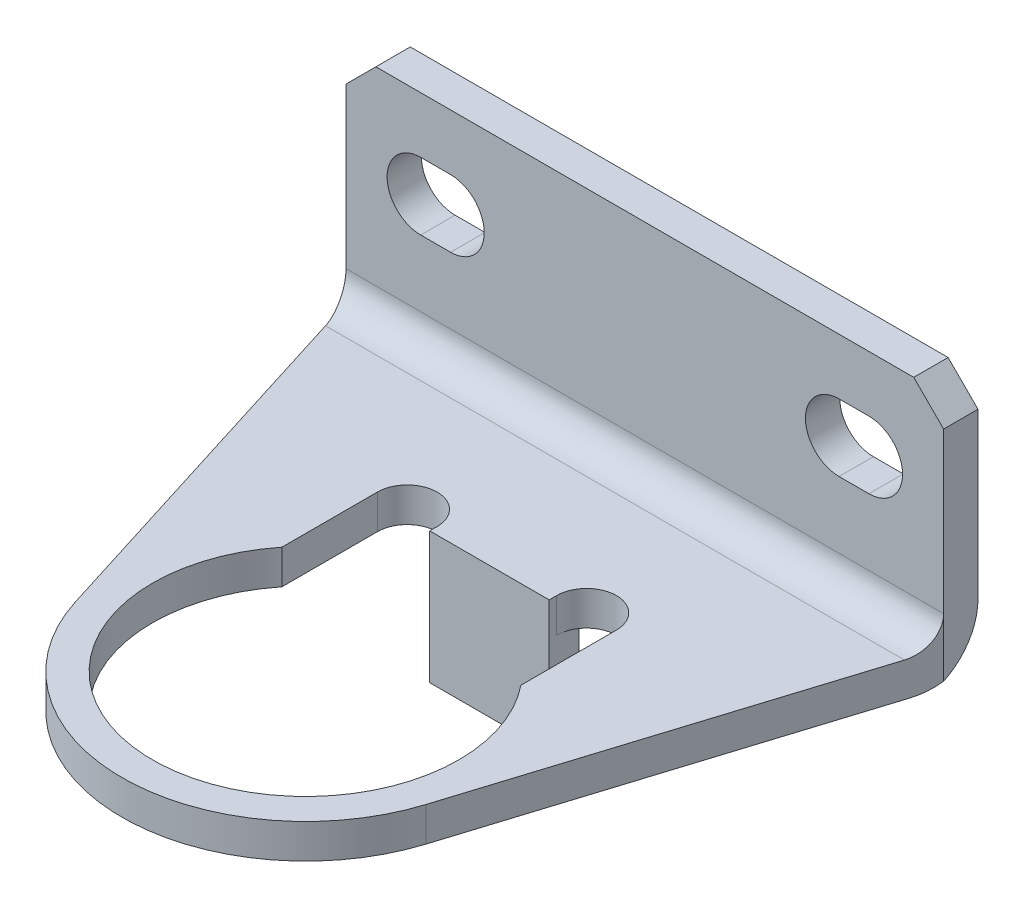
ISO-10303-21;
HEADER;
FILE_DESCRIPTION(('STEP AP214'),'2;1');
FILE_NAME('part.step','',(''),(''),'','','');
FILE_SCHEMA(('AUTOMOTIVE_DESIGN { 1 0 10303 214 1 1 1 1 }'));
ENDSEC;
DATA;
#1=APPLICATION_CONTEXT('core data for automotive mechanical design processes');
#2=APPLICATION_PROTOCOL_DEFINITION('international standard','automotive_design',2000,#1);
#3=PRODUCT_CONTEXT('',#1,'mechanical');
#4=PRODUCT('Part','Part','',(#3));
#5=PRODUCT_RELATED_PRODUCT_CATEGORY('part','',(#4));
#6=PRODUCT_DEFINITION_FORMATION('','',#4);
#7=PRODUCT_DEFINITION_CONTEXT('part definition',#1,'design');
#8=PRODUCT_DEFINITION('design','',#6,#7);
#9=PRODUCT_DEFINITION_SHAPE('','',#8);
#10=(LENGTH_UNIT() NAMED_UNIT(*) SI_UNIT(.MILLI.,.METRE.));
#11=(NAMED_UNIT(*) PLANE_ANGLE_UNIT() SI_UNIT($,.RADIAN.));
#12=(NAMED_UNIT(*) SI_UNIT($,.STERADIAN.) SOLID_ANGLE_UNIT());
#13=UNCERTAINTY_MEASURE_WITH_UNIT(LENGTH_MEASURE(1.E-05),#10,'distance_accuracy_value','');
#14=(GEOMETRIC_REPRESENTATION_CONTEXT(3) GLOBAL_UNCERTAINTY_ASSIGNED_CONTEXT((#13)) GLOBAL_UNIT_ASSIGNED_CONTEXT((#10,
#11,#12)) REPRESENTATION_CONTEXT('',''));
#15=CARTESIAN_POINT('',(0.,0.,0.));
#16=DIRECTION('',(0.,0.,1.));
#17=DIRECTION('',(1.,0.,0.));
#18=AXIS2_PLACEMENT_3D('',#15,#16,#17);
#19=CARTESIAN_POINT('',(-20.,0.,-2.3));
#20=DIRECTION('',(0.,-1.,0.));
#21=DIRECTION('',(0.,0.,-1.));
#22=AXIS2_PLACEMENT_3D('',#19,#20,#21);
#23=PLANE('',#22);
#24=DIRECTION('',(0.298922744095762,0.,0.95427731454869));
#25=VECTOR('',#24,1.);
#26=CARTESIAN_POINT('',(-20.,0.,0.));
#27=LINE('',#26,#25);
#28=CARTESIAN_POINT('',(-19.4674832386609,0.,1.7));
#29=VERTEX_POINT('',#28);
#30=CARTESIAN_POINT('',(-11.7376109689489,0.,26.3767497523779));
#31=VERTEX_POINT('',#30);
#32=EDGE_CURVE('E363',#29,#31,#27,.T.);
#33=ORIENTED_EDGE('',*,*,#32,.F.);
#34=DIRECTION('',(1.,0.,0.));
#35=VECTOR('',#34,1.);
#36=CARTESIAN_POINT('',(20.,0.,1.7));
#37=LINE('',#36,#35);
#38=CARTESIAN_POINT('',(19.467483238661,0.,1.7));
#39=VERTEX_POINT('',#38);
#40=EDGE_CURVE('E243',#29,#39,#37,.T.);
#41=ORIENTED_EDGE('',*,*,#40,.T.);
#42=DIRECTION('',(0.298922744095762,0.,-0.95427731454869));
#43=VECTOR('',#42,1.);
#44=CARTESIAN_POINT('',(20.,0.,0.));
#45=LINE('',#44,#43);
#46=CARTESIAN_POINT('',(11.7376109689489,0.,26.3767497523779));
#47=VERTEX_POINT('',#46);
#48=EDGE_CURVE('E307',#47,#39,#45,.T.);
#49=ORIENTED_EDGE('',*,*,#48,.F.);
#50=CARTESIAN_POINT('',(0.,0.,22.7));
#51=DIRECTION('',(0.,1.,0.));
#52=DIRECTION('',(0.,0.,1.));
#53=AXIS2_PLACEMENT_3D('',#50,#51,#52);
#54=CIRCLE('',#53,12.3);
#55=EDGE_CURVE('E365',#31,#47,#54,.T.);
#56=ORIENTED_EDGE('',*,*,#55,.F.);
#57=EDGE_LOOP('',(#33,#41,#49,#56));
#58=FACE_BOUND('',#57,.T.);
#59=DIRECTION('',(-1.,0.,0.));
#60=VECTOR('',#59,1.);
#61=CARTESIAN_POINT('',(-4.,0.,8.4));
#62=LINE('',#61,#60);
#63=CARTESIAN_POINT('',(4.,0.,8.4));
#64=VERTEX_POINT('',#63);
#65=CARTESIAN_POINT('',(-4.,0.,8.4));
#66=VERTEX_POINT('',#65);
#67=EDGE_CURVE('E233',#64,#66,#62,.T.);
#68=ORIENTED_EDGE('',*,*,#67,.T.);
#69=DIRECTION('',(0.,0.,1.));
#70=VECTOR('',#69,1.);
#71=CARTESIAN_POINT('',(-4.,0.,10.4));
#72=LINE('',#71,#70);
#73=CARTESIAN_POINT('',(-4.,0.,9.9));
#74=VERTEX_POINT('',#73);
#75=EDGE_CURVE('E237',#66,#74,#72,.T.);
#76=ORIENTED_EDGE('',*,*,#75,.T.);
#77=CARTESIAN_POINT('',(-6.,0.,9.9));
#78=DIRECTION('',(0.,1.,0.));
#79=DIRECTION('',(0.,0.,1.));
#80=AXIS2_PLACEMENT_3D('',#77,#78,#79);
#81=CIRCLE('',#80,2.);
#82=CARTESIAN_POINT('',(-8.,0.,9.9));
#83=VERTEX_POINT('',#82);
#84=EDGE_CURVE('E274',#74,#83,#81,.T.);
#85=ORIENTED_EDGE('',*,*,#84,.T.);
#86=DIRECTION('',(0.,0.,1.));
#87=VECTOR('',#86,1.);
#88=CARTESIAN_POINT('',(-8.,0.,9.9));
#89=LINE('',#88,#87);
#90=CARTESIAN_POINT('',(-8.,0.,16.2919971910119));
#91=VERTEX_POINT('',#90);
#92=EDGE_CURVE('E277',#83,#91,#89,.T.);
#93=ORIENTED_EDGE('',*,*,#92,.T.);
#94=CARTESIAN_POINT('',(0.,0.,22.7));
#95=DIRECTION('',(0.,1.,0.));
#96=DIRECTION('',(0.,0.,1.));
#97=AXIS2_PLACEMENT_3D('',#94,#95,#96);
#98=CIRCLE('',#97,10.25);
#99=CARTESIAN_POINT('',(8.,0.,16.2919971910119));
#100=VERTEX_POINT('',#99);
#101=EDGE_CURVE('E357',#91,#100,#98,.T.);
#102=ORIENTED_EDGE('',*,*,#101,.T.);
#103=DIRECTION('',(0.,0.,-1.));
#104=VECTOR('',#103,1.);
#105=CARTESIAN_POINT('',(8.00000000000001,0.,9.9));
#106=LINE('',#105,#104);
#107=CARTESIAN_POINT('',(8.,0.,9.9));
#108=VERTEX_POINT('',#107);
#109=EDGE_CURVE('E264',#100,#108,#106,.T.);
#110=ORIENTED_EDGE('',*,*,#109,.T.);
#111=CARTESIAN_POINT('',(6.,0.,9.9));
#112=DIRECTION('',(0.,1.,0.));
#113=DIRECTION('',(0.,0.,-1.));
#114=AXIS2_PLACEMENT_3D('',#111,#112,#113);
#115=CIRCLE('',#114,2.);
#116=CARTESIAN_POINT('',(4.,0.,9.9));
#117=VERTEX_POINT('',#116);
#118=EDGE_CURVE('E242',#108,#117,#115,.T.);
#119=ORIENTED_EDGE('',*,*,#118,.T.);
#120=DIRECTION('',(0.,0.,-1.));
#121=VECTOR('',#120,1.);
#122=CARTESIAN_POINT('',(4.,0.,10.4));
#123=LINE('',#122,#121);
#124=EDGE_CURVE('E221',#117,#64,#123,.T.);
#125=ORIENTED_EDGE('',*,*,#124,.T.);
#126=EDGE_LOOP('',(#68,#76,#85,#93,#102,#110,#119,#125));
#127=FACE_BOUND('',#126,.T.);
#128=ADVANCED_FACE('F31',(#58,#127),#23,.T.);
#129=CARTESIAN_POINT('',(0.,2.3,22.7));
#130=DIRECTION('',(0.,1.,0.));
#131=DIRECTION('',(0.,0.,1.));
#132=AXIS2_PLACEMENT_3D('',#129,#130,#131);
#133=PLANE('',#132);
#134=DIRECTION('',(0.298922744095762,0.,-0.95427731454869));
#135=VECTOR('',#134,1.);
#136=CARTESIAN_POINT('',(20.,2.3,0.));
#137=LINE('',#136,#135);
#138=CARTESIAN_POINT('',(11.7376109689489,2.3,26.3767497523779));
#139=VERTEX_POINT('',#138);
#140=CARTESIAN_POINT('',(19.3735096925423,2.3,2.));
#141=VERTEX_POINT('',#140);
#142=EDGE_CURVE('E318',#139,#141,#137,.T.);
#143=ORIENTED_EDGE('',*,*,#142,.T.);
#144=DIRECTION('',(-1.,0.,0.));
#145=VECTOR('',#144,1.);
#146=CARTESIAN_POINT('',(-20.,2.3,2.));
#147=LINE('',#146,#145);
#148=CARTESIAN_POINT('',(-19.3735096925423,2.3,2.));
#149=VERTEX_POINT('',#148);
#150=EDGE_CURVE('E582',#141,#149,#147,.T.);
#151=ORIENTED_EDGE('',*,*,#150,.T.);
#152=DIRECTION('',(0.298922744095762,0.,0.95427731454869));
#153=VECTOR('',#152,1.);
#154=CARTESIAN_POINT('',(-20.,2.3,0.));
#155=LINE('',#154,#153);
#156=CARTESIAN_POINT('',(-11.7376109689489,2.3,26.3767497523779));
#157=VERTEX_POINT('',#156);
#158=EDGE_CURVE('E303',#149,#157,#155,.T.);
#159=ORIENTED_EDGE('',*,*,#158,.T.);
#160=CARTESIAN_POINT('',(0.,2.3,22.7));
#161=DIRECTION('',(0.,1.,0.));
#162=DIRECTION('',(0.,0.,1.));
#163=AXIS2_PLACEMENT_3D('',#160,#161,#162);
#164=CIRCLE('',#163,12.3);
#165=EDGE_CURVE('E306',#157,#139,#164,.T.);
#166=ORIENTED_EDGE('',*,*,#165,.T.);
#167=EDGE_LOOP('',(#143,#151,#159,#166));
#168=FACE_BOUND('',#167,.T.);
#169=CARTESIAN_POINT('',(0.,2.3,22.7));
#170=DIRECTION('',(0.,1.,0.));
#171=DIRECTION('',(0.,0.,1.));
#172=AXIS2_PLACEMENT_3D('',#169,#170,#171);
#173=CIRCLE('',#172,10.25);
#174=CARTESIAN_POINT('',(-8.,2.3,16.2919971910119));
#175=VERTEX_POINT('',#174);
#176=CARTESIAN_POINT('',(8.,2.3,16.2919971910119));
#177=VERTEX_POINT('',#176);
#178=EDGE_CURVE('E360',#175,#177,#173,.T.);
#179=ORIENTED_EDGE('',*,*,#178,.F.);
#180=DIRECTION('',(0.,0.,-1.));
#181=VECTOR('',#180,1.);
#182=CARTESIAN_POINT('',(-8.,2.3,22.7));
#183=LINE('',#182,#181);
#184=CARTESIAN_POINT('',(-8.,2.3,9.9));
#185=VERTEX_POINT('',#184);
#186=EDGE_CURVE('E354',#175,#185,#183,.T.);
#187=ORIENTED_EDGE('',*,*,#186,.T.);
#188=CARTESIAN_POINT('',(-6.,2.3,9.9));
#189=DIRECTION('',(0.,1.,0.));
#190=DIRECTION('',(0.,0.,1.));
#191=AXIS2_PLACEMENT_3D('',#188,#189,#190);
#192=CIRCLE('',#191,2.);
#193=CARTESIAN_POINT('',(-4.,2.3,9.9));
#194=VERTEX_POINT('',#193);
#195=EDGE_CURVE('E244',#185,#194,#192,.F.);
#196=ORIENTED_EDGE('',*,*,#195,.T.);
#197=DIRECTION('',(0.,0.,1.));
#198=VECTOR('',#197,1.);
#199=CARTESIAN_POINT('',(-4.,2.3,22.7));
#200=LINE('',#199,#198);
#201=CARTESIAN_POINT('',(-4.,2.3,10.4));
#202=VERTEX_POINT('',#201);
#203=EDGE_CURVE('E250',#194,#202,#200,.T.);
#204=ORIENTED_EDGE('',*,*,#203,.T.);
#205=DIRECTION('',(1.,0.,0.));
#206=VECTOR('',#205,1.);
#207=CARTESIAN_POINT('',(0.,2.3,10.4));
#208=LINE('',#207,#206);
#209=CARTESIAN_POINT('',(4.,2.3,10.4));
#210=VERTEX_POINT('',#209);
#211=EDGE_CURVE('E331',#202,#210,#208,.T.);
#212=ORIENTED_EDGE('',*,*,#211,.T.);
#213=DIRECTION('',(0.,0.,-1.));
#214=VECTOR('',#213,1.);
#215=CARTESIAN_POINT('',(4.,2.3,22.7));
#216=LINE('',#215,#214);
#217=CARTESIAN_POINT('',(4.,2.3,9.9));
#218=VERTEX_POINT('',#217);
#219=EDGE_CURVE('E334',#210,#218,#216,.T.);
#220=ORIENTED_EDGE('',*,*,#219,.T.);
#221=CARTESIAN_POINT('',(6.,2.3,9.9));
#222=DIRECTION('',(0.,1.,0.));
#223=DIRECTION('',(0.,0.,1.));
#224=AXIS2_PLACEMENT_3D('',#221,#222,#223);
#225=CIRCLE('',#224,2.);
#226=CARTESIAN_POINT('',(8.,2.3,9.9));
#227=VERTEX_POINT('',#226);
#228=EDGE_CURVE('E337',#218,#227,#225,.F.);
#229=ORIENTED_EDGE('',*,*,#228,.T.);
#230=DIRECTION('',(0.,0.,1.));
#231=VECTOR('',#230,1.);
#232=CARTESIAN_POINT('',(8.,2.3,22.7));
#233=LINE('',#232,#231);
#234=EDGE_CURVE('E270',#227,#177,#233,.T.);
#235=ORIENTED_EDGE('',*,*,#234,.T.);
#236=EDGE_LOOP('',(#179,#187,#196,#204,#212,#220,#229,#235));
#237=FACE_BOUND('',#236,.T.);
#238=ADVANCED_FACE('F468',(#168,#237),#133,.T.);
#239=CARTESIAN_POINT('',(0.,2.3,22.7));
#240=DIRECTION('',(0.,-1.,0.));
#241=DIRECTION('',(0.,0.,-1.));
#242=AXIS2_PLACEMENT_3D('',#239,#240,#241);
#243=CYLINDRICAL_SURFACE('',#242,10.25);
#244=ORIENTED_EDGE('',*,*,#101,.F.);
#245=DIRECTION('',(0.,-1.,0.));
#246=VECTOR('',#245,1.);
#247=CARTESIAN_POINT('',(-8.,2.3,16.2919971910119));
#248=LINE('',#247,#246);
#249=EDGE_CURVE('E327',#91,#175,#248,.F.);
#250=ORIENTED_EDGE('',*,*,#249,.T.);
#251=ORIENTED_EDGE('',*,*,#178,.T.);
#252=DIRECTION('',(0.,-1.,0.));
#253=VECTOR('',#252,1.);
#254=CARTESIAN_POINT('',(8.,2.3,16.2919971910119));
#255=LINE('',#254,#253);
#256=EDGE_CURVE('E324',#177,#100,#255,.T.);
#257=ORIENTED_EDGE('',*,*,#256,.T.);
#258=EDGE_LOOP('',(#244,#250,#251,#257));
#259=FACE_BOUND('',#258,.T.);
#260=ADVANCED_FACE('F474',(#259),#243,.F.);
#261=CARTESIAN_POINT('',(-20.,0.,-2.3));
#262=DIRECTION('',(0.,0.,1.));
#263=DIRECTION('',(1.,0.,0.));
#264=AXIS2_PLACEMENT_3D('',#261,#262,#263);
#265=PLANE('',#264);
#266=DIRECTION('',(0.,1.,0.));
#267=VECTOR('',#266,1.);
#268=CARTESIAN_POINT('',(20.,17.,-2.3));
#269=LINE('',#268,#267);
#270=CARTESIAN_POINT('',(20.,4.,-2.3));
#271=VERTEX_POINT('',#270);
#272=CARTESIAN_POINT('',(20.,15.,-2.3));
#273=VERTEX_POINT('',#272);
#274=EDGE_CURVE('E631',#271,#273,#269,.T.);
#275=ORIENTED_EDGE('',*,*,#274,.F.);
#276=DIRECTION('',(1.,0.,0.));
#277=VECTOR('',#276,1.);
#278=CARTESIAN_POINT('',(-20.,4.,-2.3));
#279=LINE('',#278,#277);
#280=CARTESIAN_POINT('',(-20.,4.,-2.3));
#281=VERTEX_POINT('',#280);
#282=EDGE_CURVE('E298',#271,#281,#279,.F.);
#283=ORIENTED_EDGE('',*,*,#282,.T.);
#284=DIRECTION('',(0.,-1.,0.));
#285=VECTOR('',#284,1.);
#286=CARTESIAN_POINT('',(-20.,17.,-2.3));
#287=LINE('',#286,#285);
#288=CARTESIAN_POINT('',(-20.,15.,-2.3));
#289=VERTEX_POINT('',#288);
#290=EDGE_CURVE('E628',#289,#281,#287,.T.);
#291=ORIENTED_EDGE('',*,*,#290,.F.);
#292=DIRECTION('',(-0.707106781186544,-0.707106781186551,0.));
#293=VECTOR('',#292,1.);
#294=CARTESIAN_POINT('',(-18.,17.,-2.3));
#295=LINE('',#294,#293);
#296=CARTESIAN_POINT('',(-18.,17.,-2.3));
#297=VERTEX_POINT('',#296);
#298=EDGE_CURVE('E621',#289,#297,#295,.F.);
#299=ORIENTED_EDGE('',*,*,#298,.T.);
#300=DIRECTION('',(-1.,0.,0.));
#301=VECTOR('',#300,1.);
#302=CARTESIAN_POINT('',(-20.,17.,-2.3));
#303=LINE('',#302,#301);
#304=CARTESIAN_POINT('',(18.,17.,-2.3));
#305=VERTEX_POINT('',#304);
#306=EDGE_CURVE('E626',#305,#297,#303,.T.);
#307=ORIENTED_EDGE('',*,*,#306,.F.);
#308=DIRECTION('',(-0.707106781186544,0.707106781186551,0.));
#309=VECTOR('',#308,1.);
#310=CARTESIAN_POINT('',(20.,15.,-2.3));
#311=LINE('',#310,#309);
#312=EDGE_CURVE('E618',#305,#273,#311,.F.);
#313=ORIENTED_EDGE('',*,*,#312,.T.);
#314=EDGE_LOOP('',(#275,#283,#291,#299,#307,#313));
#315=FACE_BOUND('',#314,.T.);
#316=DIRECTION('',(1.,0.,0.));
#317=VECTOR('',#316,1.);
#318=CARTESIAN_POINT('',(-15.,13.25,-2.3));
#319=LINE('',#318,#317);
#320=CARTESIAN_POINT('',(-15.,13.25,-2.3));
#321=VERTEX_POINT('',#320);
#322=CARTESIAN_POINT('',(-13.,13.25,-2.3));
#323=VERTEX_POINT('',#322);
#324=EDGE_CURVE('E424',#321,#323,#319,.T.);
#325=ORIENTED_EDGE('',*,*,#324,.F.);
#326=CARTESIAN_POINT('',(-15.,11.,-2.3));
#327=DIRECTION('',(0.,0.,1.));
#328=DIRECTION('',(1.,0.,0.));
#329=AXIS2_PLACEMENT_3D('',#326,#327,#328);
#330=CIRCLE('',#329,2.25);
#331=CARTESIAN_POINT('',(-15.,8.75000000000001,-2.3));
#332=VERTEX_POINT('',#331);
#333=EDGE_CURVE('E416',#321,#332,#330,.T.);
#334=ORIENTED_EDGE('',*,*,#333,.T.);
#335=DIRECTION('',(-1.,0.,0.));
#336=VECTOR('',#335,1.);
#337=CARTESIAN_POINT('',(-13.,8.75000000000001,-2.3));
#338=LINE('',#337,#336);
#339=CARTESIAN_POINT('',(-13.,8.75000000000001,-2.3));
#340=VERTEX_POINT('',#339);
#341=EDGE_CURVE('E419',#340,#332,#338,.T.);
#342=ORIENTED_EDGE('',*,*,#341,.F.);
#343=CARTESIAN_POINT('',(-13.,11.,-2.3));
#344=DIRECTION('',(0.,0.,-1.));
#345=DIRECTION('',(-1.,0.,0.));
#346=AXIS2_PLACEMENT_3D('',#343,#344,#345);
#347=CIRCLE('',#346,2.25);
#348=EDGE_CURVE('E421',#323,#340,#347,.T.);
#349=ORIENTED_EDGE('',*,*,#348,.F.);
#350=EDGE_LOOP('',(#325,#334,#342,#349));
#351=FACE_BOUND('',#350,.T.);
#352=CARTESIAN_POINT('',(15.,11.,-2.3));
#353=DIRECTION('',(0.,0.,-1.));
#354=DIRECTION('',(-1.,0.,0.));
#355=AXIS2_PLACEMENT_3D('',#352,#353,#354);
#356=CIRCLE('',#355,2.24999999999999);
#357=CARTESIAN_POINT('',(15.,13.25,-2.3));
#358=VERTEX_POINT('',#357);
#359=CARTESIAN_POINT('',(15.,8.75000000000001,-2.3));
#360=VERTEX_POINT('',#359);
#361=EDGE_CURVE('E385',#358,#360,#356,.T.);
#362=ORIENTED_EDGE('',*,*,#361,.F.);
#363=DIRECTION('',(-1.,0.,0.));
#364=VECTOR('',#363,1.);
#365=CARTESIAN_POINT('',(15.,13.25,-2.3));
#366=LINE('',#365,#364);
#367=CARTESIAN_POINT('',(13.,13.25,-2.3));
#368=VERTEX_POINT('',#367);
#369=EDGE_CURVE('E393',#358,#368,#366,.T.);
#370=ORIENTED_EDGE('',*,*,#369,.T.);
#371=CARTESIAN_POINT('',(13.,11.,-2.3));
#372=DIRECTION('',(0.,0.,1.));
#373=DIRECTION('',(1.,0.,0.));
#374=AXIS2_PLACEMENT_3D('',#371,#372,#373);
#375=CIRCLE('',#374,2.24999999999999);
#376=CARTESIAN_POINT('',(13.,8.75000000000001,-2.3));
#377=VERTEX_POINT('',#376);
#378=EDGE_CURVE('E390',#368,#377,#375,.T.);
#379=ORIENTED_EDGE('',*,*,#378,.T.);
#380=DIRECTION('',(1.,0.,0.));
#381=VECTOR('',#380,1.);
#382=CARTESIAN_POINT('',(13.,8.75000000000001,-2.3));
#383=LINE('',#382,#381);
#384=EDGE_CURVE('E387',#377,#360,#383,.T.);
#385=ORIENTED_EDGE('',*,*,#384,.T.);
#386=EDGE_LOOP('',(#362,#370,#379,#385));
#387=FACE_BOUND('',#386,.T.);
#388=ADVANCED_FACE('F452',(#315,#351,#387),#265,.F.);
#389=CARTESIAN_POINT('',(-20.,0.,0.));
#390=DIRECTION('',(0.,0.,1.));
#391=DIRECTION('',(1.,0.,0.));
#392=AXIS2_PLACEMENT_3D('',#389,#390,#391);
#393=PLANE('',#392);
#394=DIRECTION('',(0.,-1.,0.));
#395=VECTOR('',#394,1.);
#396=CARTESIAN_POINT('',(-20.,17.,0.));
#397=LINE('',#396,#395);
#398=CARTESIAN_POINT('',(-20.,15.,0.));
#399=VERTEX_POINT('',#398);
#400=CARTESIAN_POINT('',(-20.,4.3,0.));
#401=VERTEX_POINT('',#400);
#402=EDGE_CURVE('E295',#399,#401,#397,.T.);
#403=ORIENTED_EDGE('',*,*,#402,.T.);
#404=DIRECTION('',(-1.,0.,0.));
#405=VECTOR('',#404,1.);
#406=CARTESIAN_POINT('',(20.,4.3,0.));
#407=LINE('',#406,#405);
#408=CARTESIAN_POINT('',(20.,4.3,0.));
#409=VERTEX_POINT('',#408);
#410=EDGE_CURVE('E580',#401,#409,#407,.F.);
#411=ORIENTED_EDGE('',*,*,#410,.T.);
#412=DIRECTION('',(0.,1.,0.));
#413=VECTOR('',#412,1.);
#414=CARTESIAN_POINT('',(20.,17.,0.));
#415=LINE('',#414,#413);
#416=CARTESIAN_POINT('',(20.,15.,0.));
#417=VERTEX_POINT('',#416);
#418=EDGE_CURVE('E285',#409,#417,#415,.T.);
#419=ORIENTED_EDGE('',*,*,#418,.T.);
#420=DIRECTION('',(0.707106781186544,-0.707106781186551,0.));
#421=VECTOR('',#420,1.);
#422=CARTESIAN_POINT('',(7.50000000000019,27.4999999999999,0.));
#423=LINE('',#422,#421);
#424=CARTESIAN_POINT('',(18.,17.,0.));
#425=VERTEX_POINT('',#424);
#426=EDGE_CURVE('E603',#417,#425,#423,.F.);
#427=ORIENTED_EDGE('',*,*,#426,.T.);
#428=DIRECTION('',(-1.,0.,0.));
#429=VECTOR('',#428,1.);
#430=CARTESIAN_POINT('',(-20.,17.,0.));
#431=LINE('',#430,#429);
#432=CARTESIAN_POINT('',(-18.,17.,0.));
#433=VERTEX_POINT('',#432);
#434=EDGE_CURVE('E284',#425,#433,#431,.T.);
#435=ORIENTED_EDGE('',*,*,#434,.T.);
#436=DIRECTION('',(0.707106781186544,0.707106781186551,0.));
#437=VECTOR('',#436,1.);
#438=CARTESIAN_POINT('',(-27.5,7.49999999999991,0.));
#439=LINE('',#438,#437);
#440=EDGE_CURVE('E608',#433,#399,#439,.F.);
#441=ORIENTED_EDGE('',*,*,#440,.T.);
#442=EDGE_LOOP('',(#403,#411,#419,#427,#435,#441));
#443=FACE_BOUND('',#442,.T.);
#444=CARTESIAN_POINT('',(-15.,11.,0.));
#445=DIRECTION('',(0.,0.,1.));
#446=DIRECTION('',(1.,0.,0.));
#447=AXIS2_PLACEMENT_3D('',#444,#445,#446);
#448=CIRCLE('',#447,2.25);
#449=CARTESIAN_POINT('',(-15.,13.25,0.));
#450=VERTEX_POINT('',#449);
#451=CARTESIAN_POINT('',(-15.,8.75000000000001,0.));
#452=VERTEX_POINT('',#451);
#453=EDGE_CURVE('E405',#450,#452,#448,.T.);
#454=ORIENTED_EDGE('',*,*,#453,.F.);
#455=DIRECTION('',(1.,0.,0.));
#456=VECTOR('',#455,1.);
#457=CARTESIAN_POINT('',(-15.,13.25,0.));
#458=LINE('',#457,#456);
#459=CARTESIAN_POINT('',(-13.,13.25,0.));
#460=VERTEX_POINT('',#459);
#461=EDGE_CURVE('E413',#450,#460,#458,.T.);
#462=ORIENTED_EDGE('',*,*,#461,.T.);
#463=CARTESIAN_POINT('',(-13.,11.,0.));
#464=DIRECTION('',(0.,0.,-1.));
#465=DIRECTION('',(-1.,0.,0.));
#466=AXIS2_PLACEMENT_3D('',#463,#464,#465);
#467=CIRCLE('',#466,2.25);
#468=CARTESIAN_POINT('',(-13.,8.75,0.));
#469=VERTEX_POINT('',#468);
#470=EDGE_CURVE('E410',#460,#469,#467,.T.);
#471=ORIENTED_EDGE('',*,*,#470,.T.);
#472=DIRECTION('',(-1.,0.,0.));
#473=VECTOR('',#472,1.);
#474=CARTESIAN_POINT('',(-13.,8.75000000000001,0.));
#475=LINE('',#474,#473);
#476=EDGE_CURVE('E407',#469,#452,#475,.T.);
#477=ORIENTED_EDGE('',*,*,#476,.T.);
#478=EDGE_LOOP('',(#454,#462,#471,#477));
#479=FACE_BOUND('',#478,.T.);
#480=DIRECTION('',(-1.,0.,0.));
#481=VECTOR('',#480,1.);
#482=CARTESIAN_POINT('',(15.,13.25,0.));
#483=LINE('',#482,#481);
#484=CARTESIAN_POINT('',(15.,13.25,0.));
#485=VERTEX_POINT('',#484);
#486=CARTESIAN_POINT('',(13.,13.25,0.));
#487=VERTEX_POINT('',#486);
#488=EDGE_CURVE('E382',#485,#487,#483,.T.);
#489=ORIENTED_EDGE('',*,*,#488,.F.);
#490=CARTESIAN_POINT('',(15.,11.,0.));
#491=DIRECTION('',(0.,0.,-1.));
#492=DIRECTION('',(-1.,0.,0.));
#493=AXIS2_PLACEMENT_3D('',#490,#491,#492);
#494=CIRCLE('',#493,2.24999999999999);
#495=CARTESIAN_POINT('',(15.,8.75000000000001,0.));
#496=VERTEX_POINT('',#495);
#497=EDGE_CURVE('E314',#485,#496,#494,.T.);
#498=ORIENTED_EDGE('',*,*,#497,.T.);
#499=DIRECTION('',(1.,0.,0.));
#500=VECTOR('',#499,1.);
#501=CARTESIAN_POINT('',(13.,8.75000000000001,0.));
#502=LINE('',#501,#500);
#503=CARTESIAN_POINT('',(13.,8.75000000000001,0.));
#504=VERTEX_POINT('',#503);
#505=EDGE_CURVE('E376',#504,#496,#502,.T.);
#506=ORIENTED_EDGE('',*,*,#505,.F.);
#507=CARTESIAN_POINT('',(13.,11.,0.));
#508=DIRECTION('',(0.,0.,1.));
#509=DIRECTION('',(1.,0.,0.));
#510=AXIS2_PLACEMENT_3D('',#507,#508,#509);
#511=CIRCLE('',#510,2.24999999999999);
#512=EDGE_CURVE('E379',#487,#504,#511,.T.);
#513=ORIENTED_EDGE('',*,*,#512,.F.);
#514=EDGE_LOOP('',(#489,#498,#506,#513));
#515=FACE_BOUND('',#514,.T.);
#516=ADVANCED_FACE('F442',(#443,#479,#515),#393,.T.);
#517=CARTESIAN_POINT('',(-20.,17.,-2.3));
#518=DIRECTION('',(-1.,0.,0.));
#519=DIRECTION('',(0.,-1.,0.));
#520=AXIS2_PLACEMENT_3D('',#517,#518,#519);
#521=PLANE('',#520);
#522=ORIENTED_EDGE('',*,*,#290,.T.);
#523=CARTESIAN_POINT('',(-20.,4.,1.7));
#524=DIRECTION('',(-1.,0.,0.));
#525=DIRECTION('',(0.,-1.,0.));
#526=AXIS2_PLACEMENT_3D('',#523,#524,#525);
#527=CIRCLE('',#526,4.);
#528=CARTESIAN_POINT('',(-20.,0.379226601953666,0.));
#529=VERTEX_POINT('',#528);
#530=EDGE_CURVE('E300',#281,#529,#527,.T.);
#531=ORIENTED_EDGE('',*,*,#530,.T.);
#532=DIRECTION('',(0.,-1.,0.));
#533=VECTOR('',#532,1.);
#534=CARTESIAN_POINT('',(-20.,2.3,0.));
#535=LINE('',#534,#533);
#536=EDGE_CURVE('E47',#401,#529,#535,.T.);
#537=ORIENTED_EDGE('',*,*,#536,.F.);
#538=ORIENTED_EDGE('',*,*,#402,.F.);
#539=DIRECTION('',(0.,0.,-1.));
#540=VECTOR('',#539,1.);
#541=CARTESIAN_POINT('',(-20.,15.,-2.3));
#542=LINE('',#541,#540);
#543=EDGE_CURVE('E611',#399,#289,#542,.T.);
#544=ORIENTED_EDGE('',*,*,#543,.T.);
#545=EDGE_LOOP('',(#522,#531,#537,#538,#544));
#546=FACE_BOUND('',#545,.T.);
#547=ADVANCED_FACE('F33',(#546),#521,.T.);
#548=CARTESIAN_POINT('',(-20.,17.,-2.3));
#549=DIRECTION('',(0.,1.,0.));
#550=DIRECTION('',(0.,0.,1.));
#551=AXIS2_PLACEMENT_3D('',#548,#549,#550);
#552=PLANE('',#551);
#553=ORIENTED_EDGE('',*,*,#306,.T.);
#554=DIRECTION('',(0.,0.,1.));
#555=VECTOR('',#554,1.);
#556=CARTESIAN_POINT('',(-18.,17.,-2.3));
#557=LINE('',#556,#555);
#558=EDGE_CURVE('E609',#297,#433,#557,.T.);
#559=ORIENTED_EDGE('',*,*,#558,.T.);
#560=ORIENTED_EDGE('',*,*,#434,.F.);
#561=DIRECTION('',(0.,0.,-1.));
#562=VECTOR('',#561,1.);
#563=CARTESIAN_POINT('',(18.,17.,-2.3));
#564=LINE('',#563,#562);
#565=EDGE_CURVE('E607',#425,#305,#564,.T.);
#566=ORIENTED_EDGE('',*,*,#565,.T.);
#567=EDGE_LOOP('',(#553,#559,#560,#566));
#568=FACE_BOUND('',#567,.T.);
#569=ADVANCED_FACE('F481',(#568),#552,.T.);
#570=CARTESIAN_POINT('',(20.,17.,-2.3));
#571=DIRECTION('',(1.,0.,0.));
#572=DIRECTION('',(0.,1.,0.));
#573=AXIS2_PLACEMENT_3D('',#570,#571,#572);
#574=PLANE('',#573);
#575=CARTESIAN_POINT('',(20.,0.379226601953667,0.));
#576=VERTEX_POINT('',#575);
#577=EDGE_CURVE('E280',#576,#409,#415,.T.);
#578=ORIENTED_EDGE('',*,*,#577,.F.);
#579=CARTESIAN_POINT('',(20.,4.,1.7));
#580=DIRECTION('',(1.,0.,0.));
#581=DIRECTION('',(0.,1.,0.));
#582=AXIS2_PLACEMENT_3D('',#579,#580,#581);
#583=CIRCLE('',#582,4.);
#584=EDGE_CURVE('E296',#576,#271,#583,.T.);
#585=ORIENTED_EDGE('',*,*,#584,.T.);
#586=ORIENTED_EDGE('',*,*,#274,.T.);
#587=DIRECTION('',(0.,0.,1.));
#588=VECTOR('',#587,1.);
#589=CARTESIAN_POINT('',(20.,15.,-2.3));
#590=LINE('',#589,#588);
#591=EDGE_CURVE('E328',#273,#417,#590,.T.);
#592=ORIENTED_EDGE('',*,*,#591,.T.);
#593=ORIENTED_EDGE('',*,*,#418,.F.);
#594=EDGE_LOOP('',(#578,#585,#586,#592,#593));
#595=FACE_BOUND('',#594,.T.);
#596=ADVANCED_FACE('F464',(#595),#574,.T.);
#597=CARTESIAN_POINT('',(-15.,11.,-2.3));
#598=DIRECTION('',(0.,0.,1.));
#599=DIRECTION('',(1.,0.,0.));
#600=AXIS2_PLACEMENT_3D('',#597,#598,#599);
#601=CYLINDRICAL_SURFACE('',#600,2.25);
#602=ORIENTED_EDGE('',*,*,#453,.T.);
#603=DIRECTION('',(0.,0.,1.));
#604=VECTOR('',#603,1.);
#605=CARTESIAN_POINT('',(-15.,8.75000000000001,-2.3));
#606=LINE('',#605,#604);
#607=EDGE_CURVE('E426',#332,#452,#606,.T.);
#608=ORIENTED_EDGE('',*,*,#607,.F.);
#609=ORIENTED_EDGE('',*,*,#333,.F.);
#610=DIRECTION('',(0.,0.,1.));
#611=VECTOR('',#610,1.);
#612=CARTESIAN_POINT('',(-15.,13.25,-2.3));
#613=LINE('',#612,#611);
#614=EDGE_CURVE('E427',#321,#450,#613,.T.);
#615=ORIENTED_EDGE('',*,*,#614,.T.);
#616=EDGE_LOOP('',(#602,#608,#609,#615));
#617=FACE_BOUND('',#616,.T.);
#618=ADVANCED_FACE('F454',(#617),#601,.F.);
#619=CARTESIAN_POINT('',(-15.,13.25,-2.3));
#620=DIRECTION('',(0.,-1.,0.));
#621=DIRECTION('',(0.,0.,-1.));
#622=AXIS2_PLACEMENT_3D('',#619,#620,#621);
#623=PLANE('',#622);
#624=ORIENTED_EDGE('',*,*,#461,.F.);
#625=ORIENTED_EDGE('',*,*,#614,.F.);
#626=ORIENTED_EDGE('',*,*,#324,.T.);
#627=DIRECTION('',(0.,0.,1.));
#628=VECTOR('',#627,1.);
#629=CARTESIAN_POINT('',(-13.,13.25,-2.3));
#630=LINE('',#629,#628);
#631=EDGE_CURVE('E429',#323,#460,#630,.T.);
#632=ORIENTED_EDGE('',*,*,#631,.T.);
#633=EDGE_LOOP('',(#624,#625,#626,#632));
#634=FACE_BOUND('',#633,.T.);
#635=ADVANCED_FACE('F456',(#634),#623,.T.);
#636=CARTESIAN_POINT('',(-13.,11.,-2.3));
#637=DIRECTION('',(0.,0.,1.));
#638=DIRECTION('',(1.,0.,0.));
#639=AXIS2_PLACEMENT_3D('',#636,#637,#638);
#640=CYLINDRICAL_SURFACE('',#639,2.25);
#641=ORIENTED_EDGE('',*,*,#470,.F.);
#642=ORIENTED_EDGE('',*,*,#631,.F.);
#643=ORIENTED_EDGE('',*,*,#348,.T.);
#644=DIRECTION('',(0.,0.,1.));
#645=VECTOR('',#644,1.);
#646=CARTESIAN_POINT('',(-13.,8.75,-2.3));
#647=LINE('',#646,#645);
#648=EDGE_CURVE('E431',#340,#469,#647,.T.);
#649=ORIENTED_EDGE('',*,*,#648,.T.);
#650=EDGE_LOOP('',(#641,#642,#643,#649));
#651=FACE_BOUND('',#650,.T.);
#652=ADVANCED_FACE('F448',(#651),#640,.F.);
#653=CARTESIAN_POINT('',(-13.,8.75000000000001,-2.3));
#654=DIRECTION('',(0.,1.,0.));
#655=DIRECTION('',(0.,0.,1.));
#656=AXIS2_PLACEMENT_3D('',#653,#654,#655);
#657=PLANE('',#656);
#658=ORIENTED_EDGE('',*,*,#476,.F.);
#659=ORIENTED_EDGE('',*,*,#648,.F.);
#660=ORIENTED_EDGE('',*,*,#341,.T.);
#661=ORIENTED_EDGE('',*,*,#607,.T.);
#662=EDGE_LOOP('',(#658,#659,#660,#661));
#663=FACE_BOUND('',#662,.T.);
#664=ADVANCED_FACE('F436',(#663),#657,.T.);
#665=CARTESIAN_POINT('',(15.,11.,-2.3));
#666=DIRECTION('',(0.,0.,1.));
#667=DIRECTION('',(1.,0.,0.));
#668=AXIS2_PLACEMENT_3D('',#665,#666,#667);
#669=CYLINDRICAL_SURFACE('',#668,2.24999999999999);
#670=ORIENTED_EDGE('',*,*,#497,.F.);
#671=DIRECTION('',(0.,0.,1.));
#672=VECTOR('',#671,1.);
#673=CARTESIAN_POINT('',(15.,13.25,-2.3));
#674=LINE('',#673,#672);
#675=EDGE_CURVE('E396',#358,#485,#674,.T.);
#676=ORIENTED_EDGE('',*,*,#675,.F.);
#677=ORIENTED_EDGE('',*,*,#361,.T.);
#678=DIRECTION('',(0.,0.,1.));
#679=VECTOR('',#678,1.);
#680=CARTESIAN_POINT('',(15.,8.75000000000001,-2.3));
#681=LINE('',#680,#679);
#682=EDGE_CURVE('E403',#360,#496,#681,.T.);
#683=ORIENTED_EDGE('',*,*,#682,.T.);
#684=EDGE_LOOP('',(#670,#676,#677,#683));
#685=FACE_BOUND('',#684,.T.);
#686=ADVANCED_FACE('F493',(#685),#669,.F.);
#687=CARTESIAN_POINT('',(13.,8.75000000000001,-2.3));
#688=DIRECTION('',(0.,-1.,0.));
#689=DIRECTION('',(0.,0.,-1.));
#690=AXIS2_PLACEMENT_3D('',#687,#688,#689);
#691=PLANE('',#690);
#692=ORIENTED_EDGE('',*,*,#505,.T.);
#693=ORIENTED_EDGE('',*,*,#682,.F.);
#694=ORIENTED_EDGE('',*,*,#384,.F.);
#695=DIRECTION('',(0.,0.,1.));
#696=VECTOR('',#695,1.);
#697=CARTESIAN_POINT('',(13.,8.75000000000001,-2.3));
#698=LINE('',#697,#696);
#699=EDGE_CURVE('E401',#377,#504,#698,.T.);
#700=ORIENTED_EDGE('',*,*,#699,.T.);
#701=EDGE_LOOP('',(#692,#693,#694,#700));
#702=FACE_BOUND('',#701,.T.);
#703=ADVANCED_FACE('F497',(#702),#691,.F.);
#704=CARTESIAN_POINT('',(13.,11.,-2.3));
#705=DIRECTION('',(0.,0.,1.));
#706=DIRECTION('',(1.,0.,0.));
#707=AXIS2_PLACEMENT_3D('',#704,#705,#706);
#708=CYLINDRICAL_SURFACE('',#707,2.24999999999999);
#709=ORIENTED_EDGE('',*,*,#512,.T.);
#710=ORIENTED_EDGE('',*,*,#699,.F.);
#711=ORIENTED_EDGE('',*,*,#378,.F.);
#712=DIRECTION('',(0.,0.,1.));
#713=VECTOR('',#712,1.);
#714=CARTESIAN_POINT('',(13.,13.25,-2.3));
#715=LINE('',#714,#713);
#716=EDGE_CURVE('E399',#368,#487,#715,.T.);
#717=ORIENTED_EDGE('',*,*,#716,.T.);
#718=EDGE_LOOP('',(#709,#710,#711,#717));
#719=FACE_BOUND('',#718,.T.);
#720=ADVANCED_FACE('F502',(#719),#708,.F.);
#721=CARTESIAN_POINT('',(15.,13.25,-2.3));
#722=DIRECTION('',(0.,1.,0.));
#723=DIRECTION('',(0.,0.,1.));
#724=AXIS2_PLACEMENT_3D('',#721,#722,#723);
#725=PLANE('',#724);
#726=ORIENTED_EDGE('',*,*,#488,.T.);
#727=ORIENTED_EDGE('',*,*,#716,.F.);
#728=ORIENTED_EDGE('',*,*,#369,.F.);
#729=ORIENTED_EDGE('',*,*,#675,.T.);
#730=EDGE_LOOP('',(#726,#727,#728,#729));
#731=FACE_BOUND('',#730,.T.);
#732=ADVANCED_FACE('F508',(#731),#725,.F.);
#733=CARTESIAN_POINT('',(-18.,17.,-2.3));
#734=DIRECTION('',(0.707106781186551,-0.707106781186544,0.));
#735=DIRECTION('',(0.707106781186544,0.707106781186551,0.));
#736=AXIS2_PLACEMENT_3D('',#733,#734,#735);
#737=PLANE('',#736);
#738=ORIENTED_EDGE('',*,*,#298,.F.);
#739=ORIENTED_EDGE('',*,*,#543,.F.);
#740=ORIENTED_EDGE('',*,*,#440,.F.);
#741=ORIENTED_EDGE('',*,*,#558,.F.);
#742=EDGE_LOOP('',(#738,#739,#740,#741));
#743=FACE_BOUND('',#742,.T.);
#744=ADVANCED_FACE('F512',(#743),#737,.F.);
#745=CARTESIAN_POINT('',(20.,15.,-2.3));
#746=DIRECTION('',(-0.707106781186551,-0.707106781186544,0.));
#747=DIRECTION('',(0.707106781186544,-0.707106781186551,0.));
#748=AXIS2_PLACEMENT_3D('',#745,#746,#747);
#749=PLANE('',#748);
#750=ORIENTED_EDGE('',*,*,#312,.F.);
#751=ORIENTED_EDGE('',*,*,#565,.F.);
#752=ORIENTED_EDGE('',*,*,#426,.F.);
#753=ORIENTED_EDGE('',*,*,#591,.F.);
#754=EDGE_LOOP('',(#750,#751,#752,#753));
#755=FACE_BOUND('',#754,.T.);
#756=ADVANCED_FACE('F516',(#755),#749,.F.);
#757=CARTESIAN_POINT('',(-20.,2.3,0.));
#758=DIRECTION('',(0.95427731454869,0.,-0.298922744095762));
#759=DIRECTION('',(-0.298922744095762,0.,-0.95427731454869));
#760=AXIS2_PLACEMENT_3D('',#757,#758,#759);
#761=PLANE('',#760);
#762=ORIENTED_EDGE('',*,*,#536,.T.);
#763=CARTESIAN_POINT('',(-19.4674832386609,4.,1.7));
#764=DIRECTION('',(0.95427731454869,0.,-0.298922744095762));
#765=DIRECTION('',(-0.298922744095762,0.,-0.95427731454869));
#766=AXIS2_PLACEMENT_3D('',#763,#764,#765);
#767=ELLIPSE('',#766,4.19165366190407,4.);
#768=EDGE_CURVE('E302',#529,#29,#767,.F.);
#769=ORIENTED_EDGE('',*,*,#768,.T.);
#770=ORIENTED_EDGE('',*,*,#32,.T.);
#771=DIRECTION('',(0.,-1.,0.));
#772=VECTOR('',#771,1.);
#773=CARTESIAN_POINT('',(-11.7376109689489,2.3,26.3767497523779));
#774=LINE('',#773,#772);
#775=EDGE_CURVE('E315',#157,#31,#774,.T.);
#776=ORIENTED_EDGE('',*,*,#775,.F.);
#777=ORIENTED_EDGE('',*,*,#158,.F.);
#778=CARTESIAN_POINT('',(-19.3735096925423,4.3,2.));
#779=DIRECTION('',(0.95427731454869,0.,-0.298922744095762));
#780=DIRECTION('',(0.298922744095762,0.,0.95427731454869));
#781=AXIS2_PLACEMENT_3D('',#778,#779,#780);
#782=ELLIPSE('',#781,2.09582683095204,2.);
#783=EDGE_CURVE('E40',#149,#401,#782,.T.);
#784=ORIENTED_EDGE('',*,*,#783,.T.);
#785=EDGE_LOOP('',(#762,#769,#770,#776,#777,#784));
#786=FACE_BOUND('',#785,.T.);
#787=ADVANCED_FACE('F520',(#786),#761,.F.);
#788=CARTESIAN_POINT('',(0.,2.3,22.7));
#789=DIRECTION('',(0.,-1.,0.));
#790=DIRECTION('',(0.,0.,-1.));
#791=AXIS2_PLACEMENT_3D('',#788,#789,#790);
#792=CYLINDRICAL_SURFACE('',#791,12.3);
#793=ORIENTED_EDGE('',*,*,#55,.T.);
#794=DIRECTION('',(0.,-1.,0.));
#795=VECTOR('',#794,1.);
#796=CARTESIAN_POINT('',(11.7376109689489,2.3,26.3767497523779));
#797=LINE('',#796,#795);
#798=EDGE_CURVE('E321',#139,#47,#797,.T.);
#799=ORIENTED_EDGE('',*,*,#798,.F.);
#800=ORIENTED_EDGE('',*,*,#165,.F.);
#801=ORIENTED_EDGE('',*,*,#775,.T.);
#802=EDGE_LOOP('',(#793,#799,#800,#801));
#803=FACE_BOUND('',#802,.T.);
#804=ADVANCED_FACE('F524',(#803),#792,.T.);
#805=CARTESIAN_POINT('',(20.,2.3,0.));
#806=DIRECTION('',(-0.95427731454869,0.,-0.298922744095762));
#807=DIRECTION('',(-0.298922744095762,0.,0.95427731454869));
#808=AXIS2_PLACEMENT_3D('',#805,#806,#807);
#809=PLANE('',#808);
#810=ORIENTED_EDGE('',*,*,#48,.T.);
#811=CARTESIAN_POINT('',(19.467483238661,4.,1.7));
#812=DIRECTION('',(-0.95427731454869,0.,-0.298922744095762));
#813=DIRECTION('',(-0.298922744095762,0.,0.95427731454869));
#814=AXIS2_PLACEMENT_3D('',#811,#812,#813);
#815=ELLIPSE('',#814,4.19165366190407,4.);
#816=EDGE_CURVE('E247',#39,#576,#815,.F.);
#817=ORIENTED_EDGE('',*,*,#816,.T.);
#818=ORIENTED_EDGE('',*,*,#577,.T.);
#819=CARTESIAN_POINT('',(19.3735096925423,4.3,2.));
#820=DIRECTION('',(-0.95427731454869,0.,-0.298922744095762));
#821=DIRECTION('',(0.298922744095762,0.,-0.95427731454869));
#822=AXIS2_PLACEMENT_3D('',#819,#820,#821);
#823=ELLIPSE('',#822,2.09582683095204,2.);
#824=EDGE_CURVE('E12',#409,#141,#823,.T.);
#825=ORIENTED_EDGE('',*,*,#824,.T.);
#826=ORIENTED_EDGE('',*,*,#142,.F.);
#827=ORIENTED_EDGE('',*,*,#798,.T.);
#828=EDGE_LOOP('',(#810,#817,#818,#825,#826,#827));
#829=FACE_BOUND('',#828,.T.);
#830=ADVANCED_FACE('F528',(#829),#809,.F.);
#831=CARTESIAN_POINT('',(-4.,17.,10.4));
#832=DIRECTION('',(-1.,0.,0.));
#833=DIRECTION('',(0.,0.,1.));
#834=AXIS2_PLACEMENT_3D('',#831,#832,#833);
#835=PLANE('',#834);
#836=DIRECTION('',(0.,-1.,0.));
#837=VECTOR('',#836,1.);
#838=CARTESIAN_POINT('',(-4.,17.,9.9));
#839=LINE('',#838,#837);
#840=EDGE_CURVE('E267',#194,#74,#839,.T.);
#841=ORIENTED_EDGE('',*,*,#840,.T.);
#842=ORIENTED_EDGE('',*,*,#75,.F.);
#843=DIRECTION('',(0.,1.,0.));
#844=VECTOR('',#843,1.);
#845=CARTESIAN_POINT('',(-4.,-6.5,8.4));
#846=LINE('',#845,#844);
#847=CARTESIAN_POINT('',(-4.,-6.5,8.4));
#848=VERTEX_POINT('',#847);
#849=EDGE_CURVE('E228',#848,#66,#846,.T.);
#850=ORIENTED_EDGE('',*,*,#849,.F.);
#851=DIRECTION('',(0.,0.,1.));
#852=VECTOR('',#851,1.);
#853=CARTESIAN_POINT('',(-4.,-6.5,10.4));
#854=LINE('',#853,#852);
#855=CARTESIAN_POINT('',(-4.,-6.5,10.4));
#856=VERTEX_POINT('',#855);
#857=EDGE_CURVE('E236',#848,#856,#854,.T.);
#858=ORIENTED_EDGE('',*,*,#857,.T.);
#859=DIRECTION('',(0.,-1.,0.));
#860=VECTOR('',#859,1.);
#861=CARTESIAN_POINT('',(-4.,17.,10.4));
#862=LINE('',#861,#860);
#863=EDGE_CURVE('E263',#202,#856,#862,.T.);
#864=ORIENTED_EDGE('',*,*,#863,.F.);
#865=ORIENTED_EDGE('',*,*,#203,.F.);
#866=EDGE_LOOP('',(#841,#842,#850,#858,#864,#865));
#867=FACE_BOUND('',#866,.T.);
#868=ADVANCED_FACE('F531',(#867),#835,.T.);
#869=CARTESIAN_POINT('',(-6.,17.,9.9));
#870=DIRECTION('',(0.,-1.,0.));
#871=DIRECTION('',(0.,0.,-1.));
#872=AXIS2_PLACEMENT_3D('',#869,#870,#871);
#873=CYLINDRICAL_SURFACE('',#872,2.);
#874=DIRECTION('',(0.,-1.,0.));
#875=VECTOR('',#874,1.);
#876=CARTESIAN_POINT('',(-8.,17.,9.9));
#877=LINE('',#876,#875);
#878=EDGE_CURVE('E271',#185,#83,#877,.T.);
#879=ORIENTED_EDGE('',*,*,#878,.T.);
#880=ORIENTED_EDGE('',*,*,#84,.F.);
#881=ORIENTED_EDGE('',*,*,#840,.F.);
#882=ORIENTED_EDGE('',*,*,#195,.F.);
#883=EDGE_LOOP('',(#879,#880,#881,#882));
#884=FACE_BOUND('',#883,.T.);
#885=ADVANCED_FACE('F539',(#884),#873,.F.);
#886=CARTESIAN_POINT('',(-8.,17.,9.9));
#887=DIRECTION('',(1.,0.,0.));
#888=DIRECTION('',(0.,0.,-1.));
#889=AXIS2_PLACEMENT_3D('',#886,#887,#888);
#890=PLANE('',#889);
#891=ORIENTED_EDGE('',*,*,#249,.F.);
#892=ORIENTED_EDGE('',*,*,#92,.F.);
#893=ORIENTED_EDGE('',*,*,#878,.F.);
#894=ORIENTED_EDGE('',*,*,#186,.F.);
#895=EDGE_LOOP('',(#891,#892,#893,#894));
#896=FACE_BOUND('',#895,.T.);
#897=ADVANCED_FACE('F543',(#896),#890,.T.);
#898=CARTESIAN_POINT('',(8.00000000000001,17.,9.9));
#899=DIRECTION('',(-1.,0.,0.));
#900=DIRECTION('',(0.,0.,1.));
#901=AXIS2_PLACEMENT_3D('',#898,#899,#900);
#902=PLANE('',#901);
#903=DIRECTION('',(0.,-1.,0.));
#904=VECTOR('',#903,1.);
#905=CARTESIAN_POINT('',(8.,17.,9.9));
#906=LINE('',#905,#904);
#907=EDGE_CURVE('E258',#227,#108,#906,.T.);
#908=ORIENTED_EDGE('',*,*,#907,.T.);
#909=ORIENTED_EDGE('',*,*,#109,.F.);
#910=ORIENTED_EDGE('',*,*,#256,.F.);
#911=ORIENTED_EDGE('',*,*,#234,.F.);
#912=EDGE_LOOP('',(#908,#909,#910,#911));
#913=FACE_BOUND('',#912,.T.);
#914=ADVANCED_FACE('F547',(#913),#902,.T.);
#915=CARTESIAN_POINT('',(6.,17.,9.9));
#916=DIRECTION('',(0.,-1.,0.));
#917=DIRECTION('',(0.,0.,-1.));
#918=AXIS2_PLACEMENT_3D('',#915,#916,#917);
#919=CYLINDRICAL_SURFACE('',#918,2.);
#920=DIRECTION('',(0.,-1.,0.));
#921=VECTOR('',#920,1.);
#922=CARTESIAN_POINT('',(4.,17.,9.9));
#923=LINE('',#922,#921);
#924=EDGE_CURVE('E256',#218,#117,#923,.T.);
#925=ORIENTED_EDGE('',*,*,#924,.T.);
#926=ORIENTED_EDGE('',*,*,#118,.F.);
#927=ORIENTED_EDGE('',*,*,#907,.F.);
#928=ORIENTED_EDGE('',*,*,#228,.F.);
#929=EDGE_LOOP('',(#925,#926,#927,#928));
#930=FACE_BOUND('',#929,.T.);
#931=ADVANCED_FACE('F551',(#930),#919,.F.);
#932=CARTESIAN_POINT('',(4.,17.,10.4));
#933=DIRECTION('',(1.,0.,0.));
#934=DIRECTION('',(0.,0.,-1.));
#935=AXIS2_PLACEMENT_3D('',#932,#933,#934);
#936=PLANE('',#935);
#937=DIRECTION('',(0.,-1.,0.));
#938=VECTOR('',#937,1.);
#939=CARTESIAN_POINT('',(4.,17.,10.4));
#940=LINE('',#939,#938);
#941=CARTESIAN_POINT('',(4.,-6.5,10.4));
#942=VERTEX_POINT('',#941);
#943=EDGE_CURVE('E259',#210,#942,#940,.T.);
#944=ORIENTED_EDGE('',*,*,#943,.T.);
#945=DIRECTION('',(0.,0.,-1.));
#946=VECTOR('',#945,1.);
#947=CARTESIAN_POINT('',(4.,-6.5,10.4));
#948=LINE('',#947,#946);
#949=CARTESIAN_POINT('',(4.,-6.5,8.4));
#950=VERTEX_POINT('',#949);
#951=EDGE_CURVE('E224',#942,#950,#948,.T.);
#952=ORIENTED_EDGE('',*,*,#951,.T.);
#953=DIRECTION('',(0.,1.,0.));
#954=VECTOR('',#953,1.);
#955=CARTESIAN_POINT('',(4.,-6.5,8.4));
#956=LINE('',#955,#954);
#957=EDGE_CURVE('E216',#950,#64,#956,.T.);
#958=ORIENTED_EDGE('',*,*,#957,.T.);
#959=ORIENTED_EDGE('',*,*,#124,.F.);
#960=ORIENTED_EDGE('',*,*,#924,.F.);
#961=ORIENTED_EDGE('',*,*,#219,.F.);
#962=EDGE_LOOP('',(#944,#952,#958,#959,#960,#961));
#963=FACE_BOUND('',#962,.T.);
#964=ADVANCED_FACE('F218',(#963),#936,.T.);
#965=CARTESIAN_POINT('',(4.,17.,10.4));
#966=DIRECTION('',(0.,0.,1.));
#967=DIRECTION('',(1.,0.,0.));
#968=AXIS2_PLACEMENT_3D('',#965,#966,#967);
#969=PLANE('',#968);
#970=ORIENTED_EDGE('',*,*,#863,.T.);
#971=DIRECTION('',(1.,0.,0.));
#972=VECTOR('',#971,1.);
#973=CARTESIAN_POINT('',(-4.,-6.5,10.4));
#974=LINE('',#973,#972);
#975=EDGE_CURVE('E779',#856,#942,#974,.T.);
#976=ORIENTED_EDGE('',*,*,#975,.T.);
#977=ORIENTED_EDGE('',*,*,#943,.F.);
#978=ORIENTED_EDGE('',*,*,#211,.F.);
#979=EDGE_LOOP('',(#970,#976,#977,#978));
#980=FACE_BOUND('',#979,.T.);
#981=ADVANCED_FACE('F558',(#980),#969,.T.);
#982=CARTESIAN_POINT('',(-4.,-6.5,8.4));
#983=DIRECTION('',(0.,0.,-1.));
#984=DIRECTION('',(-1.,0.,0.));
#985=AXIS2_PLACEMENT_3D('',#982,#983,#984);
#986=PLANE('',#985);
#987=ORIENTED_EDGE('',*,*,#67,.F.);
#988=ORIENTED_EDGE('',*,*,#957,.F.);
#989=DIRECTION('',(-1.,0.,0.));
#990=VECTOR('',#989,1.);
#991=CARTESIAN_POINT('',(-4.,-6.5,8.4));
#992=LINE('',#991,#990);
#993=EDGE_CURVE('E229',#950,#848,#992,.T.);
#994=ORIENTED_EDGE('',*,*,#993,.T.);
#995=ORIENTED_EDGE('',*,*,#849,.T.);
#996=EDGE_LOOP('',(#987,#988,#994,#995));
#997=FACE_BOUND('',#996,.T.);
#998=ADVANCED_FACE('F234',(#997),#986,.T.);
#999=CARTESIAN_POINT('',(-4.,-6.5,8.4));
#1000=DIRECTION('',(0.,-1.,0.));
#1001=DIRECTION('',(0.,0.,-1.));
#1002=AXIS2_PLACEMENT_3D('',#999,#1000,#1001);
#1003=PLANE('',#1002);
#1004=ORIENTED_EDGE('',*,*,#857,.F.);
#1005=ORIENTED_EDGE('',*,*,#993,.F.);
#1006=ORIENTED_EDGE('',*,*,#951,.F.);
#1007=ORIENTED_EDGE('',*,*,#975,.F.);
#1008=EDGE_LOOP('',(#1004,#1005,#1006,#1007));
#1009=FACE_BOUND('',#1008,.T.);
#1010=ADVANCED_FACE('F564',(#1009),#1003,.T.);
#1011=CARTESIAN_POINT('',(-20.,4.,1.7));
#1012=DIRECTION('',(-1.,0.,0.));
#1013=DIRECTION('',(0.,0.,1.));
#1014=AXIS2_PLACEMENT_3D('',#1011,#1012,#1013);
#1015=CYLINDRICAL_SURFACE('',#1014,4.);
#1016=ORIENTED_EDGE('',*,*,#530,.F.);
#1017=ORIENTED_EDGE('',*,*,#282,.F.);
#1018=ORIENTED_EDGE('',*,*,#584,.F.);
#1019=ORIENTED_EDGE('',*,*,#816,.F.);
#1020=ORIENTED_EDGE('',*,*,#40,.F.);
#1021=ORIENTED_EDGE('',*,*,#768,.F.);
#1022=EDGE_LOOP('',(#1016,#1017,#1018,#1019,#1020,#1021));
#1023=FACE_BOUND('',#1022,.T.);
#1024=ADVANCED_FACE('F566',(#1023),#1015,.T.);
#1025=CARTESIAN_POINT('',(0.,4.3,2.));
#1026=DIRECTION('',(1.,0.,0.));
#1027=DIRECTION('',(0.,0.,-1.));
#1028=AXIS2_PLACEMENT_3D('',#1025,#1026,#1027);
#1029=CYLINDRICAL_SURFACE('',#1028,2.);
#1030=ORIENTED_EDGE('',*,*,#824,.F.);
#1031=ORIENTED_EDGE('',*,*,#410,.F.);
#1032=ORIENTED_EDGE('',*,*,#783,.F.);
#1033=ORIENTED_EDGE('',*,*,#150,.F.);
#1034=EDGE_LOOP('',(#1030,#1031,#1032,#1033));
#1035=FACE_BOUND('',#1034,.T.);
#1036=ADVANCED_FACE('F570',(#1035),#1029,.F.);
#1037=CLOSED_SHELL('',(#128,#238,#260,#388,#516,#547,#569,#596,#618,#635,#652,#664,#686,#703,
#720,#732,#744,#756,#787,#804,#830,#868,#885,#897,#914,#931,#964,#981,#998,#1010,#1024,#1036));
#1038=MANIFOLD_SOLID_BREP('B2',#1037);
#1039=ADVANCED_BREP_SHAPE_REPRESENTATION('',(#18,#1038),#14);
#1040=SHAPE_DEFINITION_REPRESENTATION(#9,#1039);
ENDSEC;
END-ISO-10303-21;
